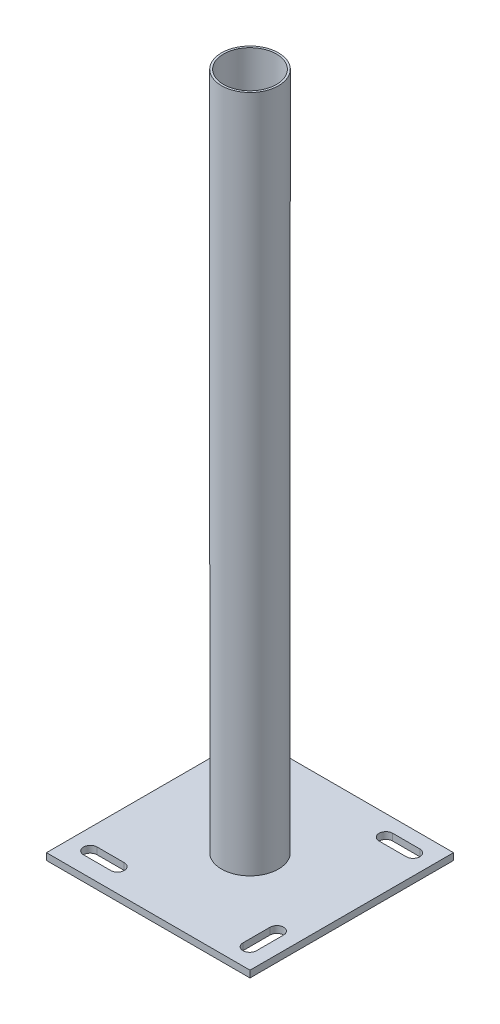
ISO-10303-21;
HEADER;
FILE_DESCRIPTION(('STEP AP214'),'2;1');
FILE_NAME('part.step','',(''),(''),'','','');
FILE_SCHEMA(('AUTOMOTIVE_DESIGN { 1 0 10303 214 1 1 1 1 }'));
ENDSEC;
DATA;
#1=APPLICATION_CONTEXT('core data for automotive mechanical design processes');
#2=APPLICATION_PROTOCOL_DEFINITION('international standard','automotive_design',2000,#1);
#3=PRODUCT_CONTEXT('',#1,'mechanical');
#4=PRODUCT('Part','Part','',(#3));
#5=PRODUCT_RELATED_PRODUCT_CATEGORY('part','',(#4));
#6=PRODUCT_DEFINITION_FORMATION('','',#4);
#7=PRODUCT_DEFINITION_CONTEXT('part definition',#1,'design');
#8=PRODUCT_DEFINITION('design','',#6,#7);
#9=PRODUCT_DEFINITION_SHAPE('','',#8);
#10=(LENGTH_UNIT() NAMED_UNIT(*) SI_UNIT(.MILLI.,.METRE.));
#11=(NAMED_UNIT(*) PLANE_ANGLE_UNIT() SI_UNIT($,.RADIAN.));
#12=(NAMED_UNIT(*) SI_UNIT($,.STERADIAN.) SOLID_ANGLE_UNIT());
#13=UNCERTAINTY_MEASURE_WITH_UNIT(LENGTH_MEASURE(1.E-05),#10,'distance_accuracy_value','');
#14=(GEOMETRIC_REPRESENTATION_CONTEXT(3) GLOBAL_UNCERTAINTY_ASSIGNED_CONTEXT((#13)) GLOBAL_UNIT_ASSIGNED_CONTEXT((#10,
#11,#12)) REPRESENTATION_CONTEXT('',''));
#15=CARTESIAN_POINT('',(0.,0.,0.));
#16=DIRECTION('',(0.,0.,1.));
#17=DIRECTION('',(1.,0.,0.));
#18=AXIS2_PLACEMENT_3D('',#15,#16,#17);
#19=CARTESIAN_POINT('',(-19.734,5.,-19.734));
#20=DIRECTION('',(0.,1.,0.));
#21=DIRECTION('',(0.,0.,1.));
#22=AXIS2_PLACEMENT_3D('',#19,#20,#21);
#23=PLANE('',#22);
#24=CARTESIAN_POINT('',(0.,5.,0.));
#25=DIRECTION('',(0.,-1.,0.));
#26=DIRECTION('',(0.,0.,-1.));
#27=AXIS2_PLACEMENT_3D('',#24,#25,#26);
#28=CIRCLE('',#27,19.5);
#29=CARTESIAN_POINT('',(0.,5.,-19.5));
#30=VERTEX_POINT('',#29);
#31=EDGE_CURVE('E21',#30,#30,#28,.F.);
#32=ORIENTED_EDGE('',*,*,#31,.T.);
#33=EDGE_LOOP('',(#32));
#34=FACE_BOUND('',#33,.T.);
#35=ADVANCED_FACE('F17',(#34),#23,.T.);
#36=CARTESIAN_POINT('',(0.,505.,0.));
#37=DIRECTION('',(0.,-1.,0.));
#38=DIRECTION('',(0.,0.,-1.));
#39=AXIS2_PLACEMENT_3D('',#36,#37,#38);
#40=CYLINDRICAL_SURFACE('',#39,19.5);
#41=CARTESIAN_POINT('',(0.,505.,0.));
#42=DIRECTION('',(0.,-1.,0.));
#43=DIRECTION('',(0.,0.,-1.));
#44=AXIS2_PLACEMENT_3D('',#41,#42,#43);
#45=CIRCLE('',#44,19.5);
#46=CARTESIAN_POINT('',(0.,505.,-19.5));
#47=VERTEX_POINT('',#46);
#48=EDGE_CURVE('E283',#47,#47,#45,.T.);
#49=ORIENTED_EDGE('',*,*,#48,.F.);
#50=EDGE_LOOP('',(#49));
#51=FACE_BOUND('',#50,.T.);
#52=ORIENTED_EDGE('',*,*,#31,.F.);
#53=EDGE_LOOP('',(#52));
#54=FACE_BOUND('',#53,.T.);
#55=ADVANCED_FACE('F291',(#51,#54),#40,.F.);
#56=CARTESIAN_POINT('',(-21.252,505.,-21.252));
#57=DIRECTION('',(0.,1.,0.));
#58=DIRECTION('',(0.,0.,1.));
#59=AXIS2_PLACEMENT_3D('',#56,#57,#58);
#60=PLANE('',#59);
#61=ORIENTED_EDGE('',*,*,#48,.T.);
#62=EDGE_LOOP('',(#61));
#63=FACE_BOUND('',#62,.T.);
#64=CARTESIAN_POINT('',(0.,505.,0.));
#65=DIRECTION('',(0.,-1.,0.));
#66=DIRECTION('',(0.,0.,-1.));
#67=AXIS2_PLACEMENT_3D('',#64,#65,#66);
#68=CIRCLE('',#67,21.);
#69=CARTESIAN_POINT('',(0.,505.,-21.));
#70=VERTEX_POINT('',#69);
#71=EDGE_CURVE('E226',#70,#70,#68,.T.);
#72=ORIENTED_EDGE('',*,*,#71,.F.);
#73=EDGE_LOOP('',(#72));
#74=FACE_BOUND('',#73,.T.);
#75=ADVANCED_FACE('F293',(#63,#74),#60,.T.);
#76=CARTESIAN_POINT('',(0.,505.,0.));
#77=DIRECTION('',(0.,-1.,0.));
#78=DIRECTION('',(0.,0.,-1.));
#79=AXIS2_PLACEMENT_3D('',#76,#77,#78);
#80=CYLINDRICAL_SURFACE('',#79,21.);
#81=CARTESIAN_POINT('',(0.,5.,0.));
#82=DIRECTION('',(0.,1.,0.));
#83=DIRECTION('',(0.,0.,1.));
#84=AXIS2_PLACEMENT_3D('',#81,#82,#83);
#85=CIRCLE('',#84,21.);
#86=CARTESIAN_POINT('',(0.,5.,21.));
#87=VERTEX_POINT('',#86);
#88=EDGE_CURVE('E221',#87,#87,#85,.F.);
#89=ORIENTED_EDGE('',*,*,#88,.F.);
#90=EDGE_LOOP('',(#89));
#91=FACE_BOUND('',#90,.T.);
#92=ORIENTED_EDGE('',*,*,#71,.T.);
#93=EDGE_LOOP('',(#92));
#94=FACE_BOUND('',#93,.T.);
#95=ADVANCED_FACE('F301',(#91,#94),#80,.T.);
#96=CARTESIAN_POINT('',(-75.,0.,-75.));
#97=DIRECTION('',(0.,0.,1.));
#98=DIRECTION('',(1.,0.,0.));
#99=AXIS2_PLACEMENT_3D('',#96,#97,#98);
#100=PLANE('',#99);
#101=DIRECTION('',(0.,1.,0.));
#102=VECTOR('',#101,1.);
#103=CARTESIAN_POINT('',(-75.,2.5,-75.));
#104=LINE('',#103,#102);
#105=CARTESIAN_POINT('',(-75.,0.,-75.));
#106=VERTEX_POINT('',#105);
#107=CARTESIAN_POINT('',(-75.,5.,-75.));
#108=VERTEX_POINT('',#107);
#109=EDGE_CURVE('E177',#106,#108,#104,.T.);
#110=ORIENTED_EDGE('',*,*,#109,.T.);
#111=DIRECTION('',(-1.,0.,0.));
#112=VECTOR('',#111,1.);
#113=CARTESIAN_POINT('',(0.,5.,-75.));
#114=LINE('',#113,#112);
#115=CARTESIAN_POINT('',(75.,5.,-75.));
#116=VERTEX_POINT('',#115);
#117=EDGE_CURVE('E169',#116,#108,#114,.T.);
#118=ORIENTED_EDGE('',*,*,#117,.F.);
#119=DIRECTION('',(0.,-1.,0.));
#120=VECTOR('',#119,1.);
#121=CARTESIAN_POINT('',(75.,2.5,-75.));
#122=LINE('',#121,#120);
#123=CARTESIAN_POINT('',(75.,0.,-75.));
#124=VERTEX_POINT('',#123);
#125=EDGE_CURVE('E156',#116,#124,#122,.T.);
#126=ORIENTED_EDGE('',*,*,#125,.T.);
#127=DIRECTION('',(-1.,0.,0.));
#128=VECTOR('',#127,1.);
#129=CARTESIAN_POINT('',(0.,0.,-75.));
#130=LINE('',#129,#128);
#131=EDGE_CURVE('E220',#124,#106,#130,.T.);
#132=ORIENTED_EDGE('',*,*,#131,.T.);
#133=EDGE_LOOP('',(#110,#118,#126,#132));
#134=FACE_BOUND('',#133,.T.);
#135=ADVANCED_FACE('F175',(#134),#100,.F.);
#136=CARTESIAN_POINT('',(-75.,0.,75.));
#137=DIRECTION('',(1.,0.,0.));
#138=DIRECTION('',(0.,0.,-1.));
#139=AXIS2_PLACEMENT_3D('',#136,#137,#138);
#140=PLANE('',#139);
#141=DIRECTION('',(0.,1.,0.));
#142=VECTOR('',#141,1.);
#143=CARTESIAN_POINT('',(-75.,2.5,75.));
#144=LINE('',#143,#142);
#145=CARTESIAN_POINT('',(-75.,0.,75.));
#146=VERTEX_POINT('',#145);
#147=CARTESIAN_POINT('',(-75.,5.,75.));
#148=VERTEX_POINT('',#147);
#149=EDGE_CURVE('E224',#146,#148,#144,.T.);
#150=ORIENTED_EDGE('',*,*,#149,.T.);
#151=DIRECTION('',(0.,0.,1.));
#152=VECTOR('',#151,1.);
#153=CARTESIAN_POINT('',(-75.,5.,0.));
#154=LINE('',#153,#152);
#155=EDGE_CURVE('E141',#108,#148,#154,.T.);
#156=ORIENTED_EDGE('',*,*,#155,.F.);
#157=ORIENTED_EDGE('',*,*,#109,.F.);
#158=DIRECTION('',(0.,0.,1.));
#159=VECTOR('',#158,1.);
#160=CARTESIAN_POINT('',(-75.,0.,0.));
#161=LINE('',#160,#159);
#162=EDGE_CURVE('E328',#106,#146,#161,.T.);
#163=ORIENTED_EDGE('',*,*,#162,.T.);
#164=EDGE_LOOP('',(#150,#156,#157,#163));
#165=FACE_BOUND('',#164,.T.);
#166=ADVANCED_FACE('F416',(#165),#140,.F.);
#167=CARTESIAN_POINT('',(75.,0.,75.));
#168=DIRECTION('',(0.,0.,-1.));
#169=DIRECTION('',(-1.,0.,0.));
#170=AXIS2_PLACEMENT_3D('',#167,#168,#169);
#171=PLANE('',#170);
#172=DIRECTION('',(0.,1.,0.));
#173=VECTOR('',#172,1.);
#174=CARTESIAN_POINT('',(75.,2.5,75.));
#175=LINE('',#174,#173);
#176=CARTESIAN_POINT('',(75.,0.,75.));
#177=VERTEX_POINT('',#176);
#178=CARTESIAN_POINT('',(75.,5.,75.));
#179=VERTEX_POINT('',#178);
#180=EDGE_CURVE('E166',#177,#179,#175,.T.);
#181=ORIENTED_EDGE('',*,*,#180,.T.);
#182=DIRECTION('',(1.,0.,0.));
#183=VECTOR('',#182,1.);
#184=CARTESIAN_POINT('',(0.,5.,75.));
#185=LINE('',#184,#183);
#186=EDGE_CURVE('E172',#148,#179,#185,.T.);
#187=ORIENTED_EDGE('',*,*,#186,.F.);
#188=ORIENTED_EDGE('',*,*,#149,.F.);
#189=DIRECTION('',(1.,0.,0.));
#190=VECTOR('',#189,1.);
#191=CARTESIAN_POINT('',(0.,0.,75.));
#192=LINE('',#191,#190);
#193=EDGE_CURVE('E321',#146,#177,#192,.T.);
#194=ORIENTED_EDGE('',*,*,#193,.T.);
#195=EDGE_LOOP('',(#181,#187,#188,#194));
#196=FACE_BOUND('',#195,.T.);
#197=ADVANCED_FACE('F413',(#196),#171,.F.);
#198=CARTESIAN_POINT('',(75.,0.,-75.));
#199=DIRECTION('',(-1.,0.,0.));
#200=DIRECTION('',(0.,0.,1.));
#201=AXIS2_PLACEMENT_3D('',#198,#199,#200);
#202=PLANE('',#201);
#203=ORIENTED_EDGE('',*,*,#125,.F.);
#204=DIRECTION('',(0.,0.,-1.));
#205=VECTOR('',#204,1.);
#206=CARTESIAN_POINT('',(75.,5.,0.));
#207=LINE('',#206,#205);
#208=EDGE_CURVE('E160',#179,#116,#207,.T.);
#209=ORIENTED_EDGE('',*,*,#208,.F.);
#210=ORIENTED_EDGE('',*,*,#180,.F.);
#211=DIRECTION('',(0.,0.,-1.));
#212=VECTOR('',#211,1.);
#213=CARTESIAN_POINT('',(75.,0.,0.));
#214=LINE('',#213,#212);
#215=EDGE_CURVE('E162',#177,#124,#214,.T.);
#216=ORIENTED_EDGE('',*,*,#215,.T.);
#217=EDGE_LOOP('',(#203,#209,#210,#216));
#218=FACE_BOUND('',#217,.T.);
#219=ADVANCED_FACE('F158',(#218),#202,.F.);
#220=CARTESIAN_POINT('',(54.965005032,0.,40.172757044));
#221=DIRECTION('',(-1.,0.,0.));
#222=DIRECTION('',(0.,0.,1.));
#223=AXIS2_PLACEMENT_3D('',#220,#221,#222);
#224=PLANE('',#223);
#225=DIRECTION('',(0.,0.,-1.));
#226=VECTOR('',#225,1.);
#227=CARTESIAN_POINT('',(54.96500505,5.,0.));
#228=LINE('',#227,#226);
#229=CARTESIAN_POINT('',(54.965005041,5.,60.172757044));
#230=VERTEX_POINT('',#229);
#231=CARTESIAN_POINT('',(54.965005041,5.,40.172757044));
#232=VERTEX_POINT('',#231);
#233=EDGE_CURVE('E279',#230,#232,#228,.T.);
#234=ORIENTED_EDGE('',*,*,#233,.F.);
#235=DIRECTION('',(0.,-1.,0.));
#236=VECTOR('',#235,1.);
#237=CARTESIAN_POINT('',(54.965005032,2.5,60.172757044));
#238=LINE('',#237,#236);
#239=CARTESIAN_POINT('',(54.965005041,0.,60.172757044));
#240=VERTEX_POINT('',#239);
#241=EDGE_CURVE('E218',#230,#240,#238,.T.);
#242=ORIENTED_EDGE('',*,*,#241,.T.);
#243=DIRECTION('',(0.,0.,-1.));
#244=VECTOR('',#243,1.);
#245=CARTESIAN_POINT('',(54.96500505,0.,0.));
#246=LINE('',#245,#244);
#247=CARTESIAN_POINT('',(54.965005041,0.,40.172757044));
#248=VERTEX_POINT('',#247);
#249=EDGE_CURVE('E258',#240,#248,#246,.T.);
#250=ORIENTED_EDGE('',*,*,#249,.T.);
#251=DIRECTION('',(0.,1.,0.));
#252=VECTOR('',#251,1.);
#253=CARTESIAN_POINT('',(54.965005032,2.5,40.172757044));
#254=LINE('',#253,#252);
#255=EDGE_CURVE('E132',#248,#232,#254,.T.);
#256=ORIENTED_EDGE('',*,*,#255,.T.);
#257=EDGE_LOOP('',(#234,#242,#250,#256));
#258=FACE_BOUND('',#257,.T.);
#259=ADVANCED_FACE('F317',(#258),#224,.F.);
#260=CARTESIAN_POINT('',(59.965005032,-0.5,40.172757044));
#261=DIRECTION('',(0.,1.,0.));
#262=DIRECTION('',(0.,0.,1.));
#263=AXIS2_PLACEMENT_3D('',#260,#261,#262);
#264=CYLINDRICAL_SURFACE('',#263,4.99999999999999);
#265=CARTESIAN_POINT('',(59.965005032,5.,40.172757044));
#266=DIRECTION('',(0.,1.,0.));
#267=DIRECTION('',(0.,0.,1.));
#268=AXIS2_PLACEMENT_3D('',#265,#266,#267);
#269=CIRCLE('',#268,4.99999999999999);
#270=CARTESIAN_POINT('',(64.965005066,5.,40.172757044));
#271=VERTEX_POINT('',#270);
#272=EDGE_CURVE('E280',#232,#271,#269,.F.);
#273=ORIENTED_EDGE('',*,*,#272,.F.);
#274=ORIENTED_EDGE('',*,*,#255,.F.);
#275=CARTESIAN_POINT('',(59.965005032,0.,40.172757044));
#276=DIRECTION('',(0.,1.,0.));
#277=DIRECTION('',(0.,0.,1.));
#278=AXIS2_PLACEMENT_3D('',#275,#276,#277);
#279=CIRCLE('',#278,4.99999999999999);
#280=CARTESIAN_POINT('',(64.965005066,0.,40.172757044));
#281=VERTEX_POINT('',#280);
#282=EDGE_CURVE('E255',#248,#281,#279,.F.);
#283=ORIENTED_EDGE('',*,*,#282,.T.);
#284=DIRECTION('',(0.,1.,0.));
#285=VECTOR('',#284,1.);
#286=CARTESIAN_POINT('',(64.965005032,2.5,40.172757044));
#287=LINE('',#286,#285);
#288=EDGE_CURVE('E173',#281,#271,#287,.T.);
#289=ORIENTED_EDGE('',*,*,#288,.T.);
#290=EDGE_LOOP('',(#273,#274,#283,#289));
#291=FACE_BOUND('',#290,.T.);
#292=ADVANCED_FACE('F348',(#291),#264,.F.);
#293=CARTESIAN_POINT('',(-39.965005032,-0.5,57.715011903));
#294=DIRECTION('',(0.,1.,0.));
#295=DIRECTION('',(-1.,0.,0.));
#296=AXIS2_PLACEMENT_3D('',#293,#294,#295);
#297=CYLINDRICAL_SURFACE('',#296,5.);
#298=CARTESIAN_POINT('',(-39.965005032,5.,57.715011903));
#299=DIRECTION('',(0.,1.,0.));
#300=DIRECTION('',(-1.,0.,0.));
#301=AXIS2_PLACEMENT_3D('',#298,#299,#300);
#302=CIRCLE('',#301,5.);
#303=CARTESIAN_POINT('',(-39.965005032,5.,52.7150119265));
#304=VERTEX_POINT('',#303);
#305=CARTESIAN_POINT('',(-39.965005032,5.,62.7150118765));
#306=VERTEX_POINT('',#305);
#307=EDGE_CURVE('E274',#304,#306,#302,.F.);
#308=ORIENTED_EDGE('',*,*,#307,.F.);
#309=DIRECTION('',(0.,-1.,0.));
#310=VECTOR('',#309,1.);
#311=CARTESIAN_POINT('',(-39.965005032,2.5,52.715011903));
#312=LINE('',#311,#310);
#313=CARTESIAN_POINT('',(-39.965005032,0.,52.7150119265));
#314=VERTEX_POINT('',#313);
#315=EDGE_CURVE('E204',#304,#314,#312,.T.);
#316=ORIENTED_EDGE('',*,*,#315,.T.);
#317=CARTESIAN_POINT('',(-39.965005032,0.,57.715011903));
#318=DIRECTION('',(0.,1.,0.));
#319=DIRECTION('',(-1.,0.,0.));
#320=AXIS2_PLACEMENT_3D('',#317,#318,#319);
#321=CIRCLE('',#320,5.);
#322=CARTESIAN_POINT('',(-39.965005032,0.,62.7150118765));
#323=VERTEX_POINT('',#322);
#324=EDGE_CURVE('E251',#314,#323,#321,.F.);
#325=ORIENTED_EDGE('',*,*,#324,.T.);
#326=DIRECTION('',(0.,1.,0.));
#327=VECTOR('',#326,1.);
#328=CARTESIAN_POINT('',(-39.965005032,2.5,62.715011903));
#329=LINE('',#328,#327);
#330=EDGE_CURVE('E212',#323,#306,#329,.T.);
#331=ORIENTED_EDGE('',*,*,#330,.T.);
#332=EDGE_LOOP('',(#308,#316,#325,#331));
#333=FACE_BOUND('',#332,.T.);
#334=ADVANCED_FACE('F402',(#333),#297,.F.);
#335=CARTESIAN_POINT('',(-59.965005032,0.,62.715011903));
#336=DIRECTION('',(0.,0.,1.));
#337=DIRECTION('',(1.,0.,0.));
#338=AXIS2_PLACEMENT_3D('',#335,#336,#337);
#339=PLANE('',#338);
#340=DIRECTION('',(-1.,0.,0.));
#341=VECTOR('',#340,1.);
#342=CARTESIAN_POINT('',(0.,5.,62.71501185));
#343=LINE('',#342,#341);
#344=CARTESIAN_POINT('',(-59.965005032,5.,62.7150118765));
#345=VERTEX_POINT('',#344);
#346=EDGE_CURVE('E273',#306,#345,#343,.T.);
#347=ORIENTED_EDGE('',*,*,#346,.F.);
#348=ORIENTED_EDGE('',*,*,#330,.F.);
#349=DIRECTION('',(-1.,0.,0.));
#350=VECTOR('',#349,1.);
#351=CARTESIAN_POINT('',(0.,0.,62.71501185));
#352=LINE('',#351,#350);
#353=CARTESIAN_POINT('',(-59.965005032,0.,62.7150118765));
#354=VERTEX_POINT('',#353);
#355=EDGE_CURVE('E250',#323,#354,#352,.T.);
#356=ORIENTED_EDGE('',*,*,#355,.T.);
#357=DIRECTION('',(0.,1.,0.));
#358=VECTOR('',#357,1.);
#359=CARTESIAN_POINT('',(-59.965005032,2.5,62.715011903));
#360=LINE('',#359,#358);
#361=EDGE_CURVE('E208',#354,#345,#360,.T.);
#362=ORIENTED_EDGE('',*,*,#361,.T.);
#363=EDGE_LOOP('',(#347,#348,#356,#362));
#364=FACE_BOUND('',#363,.T.);
#365=ADVANCED_FACE('F398',(#364),#339,.F.);
#366=CARTESIAN_POINT('',(-59.965005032,-0.5,57.715011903));
#367=DIRECTION('',(0.,1.,0.));
#368=DIRECTION('',(0.,0.,1.));
#369=AXIS2_PLACEMENT_3D('',#366,#367,#368);
#370=CYLINDRICAL_SURFACE('',#369,5.);
#371=CARTESIAN_POINT('',(-59.965005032,5.,57.715011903));
#372=DIRECTION('',(0.,1.,0.));
#373=DIRECTION('',(0.,0.,1.));
#374=AXIS2_PLACEMENT_3D('',#371,#372,#373);
#375=CIRCLE('',#374,5.);
#376=CARTESIAN_POINT('',(-59.965005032,5.,52.7150119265));
#377=VERTEX_POINT('',#376);
#378=EDGE_CURVE('E277',#345,#377,#375,.F.);
#379=ORIENTED_EDGE('',*,*,#378,.F.);
#380=ORIENTED_EDGE('',*,*,#361,.F.);
#381=CARTESIAN_POINT('',(-59.965005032,0.,57.715011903));
#382=DIRECTION('',(0.,1.,0.));
#383=DIRECTION('',(0.,0.,1.));
#384=AXIS2_PLACEMENT_3D('',#381,#382,#383);
#385=CIRCLE('',#384,5.);
#386=CARTESIAN_POINT('',(-59.965005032,0.,52.7150119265));
#387=VERTEX_POINT('',#386);
#388=EDGE_CURVE('E247',#354,#387,#385,.F.);
#389=ORIENTED_EDGE('',*,*,#388,.T.);
#390=DIRECTION('',(0.,1.,0.));
#391=VECTOR('',#390,1.);
#392=CARTESIAN_POINT('',(-59.965005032,2.5,52.715011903));
#393=LINE('',#392,#391);
#394=EDGE_CURVE('E205',#387,#377,#393,.T.);
#395=ORIENTED_EDGE('',*,*,#394,.T.);
#396=EDGE_LOOP('',(#379,#380,#389,#395));
#397=FACE_BOUND('',#396,.T.);
#398=ADVANCED_FACE('F394',(#397),#370,.F.);
#399=CARTESIAN_POINT('',(-39.965005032,0.,52.715011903));
#400=DIRECTION('',(0.,0.,-1.));
#401=DIRECTION('',(-1.,0.,0.));
#402=AXIS2_PLACEMENT_3D('',#399,#400,#401);
#403=PLANE('',#402);
#404=DIRECTION('',(1.,0.,0.));
#405=VECTOR('',#404,1.);
#406=CARTESIAN_POINT('',(0.,5.,52.71501195));
#407=LINE('',#406,#405);
#408=EDGE_CURVE('E276',#377,#304,#407,.T.);
#409=ORIENTED_EDGE('',*,*,#408,.F.);
#410=ORIENTED_EDGE('',*,*,#394,.F.);
#411=DIRECTION('',(1.,0.,0.));
#412=VECTOR('',#411,1.);
#413=CARTESIAN_POINT('',(0.,0.,52.71501195));
#414=LINE('',#413,#412);
#415=EDGE_CURVE('E246',#387,#314,#414,.T.);
#416=ORIENTED_EDGE('',*,*,#415,.T.);
#417=ORIENTED_EDGE('',*,*,#315,.F.);
#418=EDGE_LOOP('',(#409,#410,#416,#417));
#419=FACE_BOUND('',#418,.T.);
#420=ADVANCED_FACE('F390',(#419),#403,.F.);
#421=CARTESIAN_POINT('',(60.172757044,-0.5,-59.965005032));
#422=DIRECTION('',(0.,1.,0.));
#423=DIRECTION('',(-1.,0.,0.));
#424=AXIS2_PLACEMENT_3D('',#421,#422,#423);
#425=CYLINDRICAL_SURFACE('',#424,4.99999999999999);
#426=CARTESIAN_POINT('',(60.172757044,5.,-59.965005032));
#427=DIRECTION('',(0.,1.,0.));
#428=DIRECTION('',(-1.,0.,0.));
#429=AXIS2_PLACEMENT_3D('',#426,#427,#428);
#430=CIRCLE('',#429,4.99999999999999);
#431=CARTESIAN_POINT('',(60.172757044,5.,-64.965005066));
#432=VERTEX_POINT('',#431);
#433=CARTESIAN_POINT('',(60.172757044,5.,-54.965005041));
#434=VERTEX_POINT('',#433);
#435=EDGE_CURVE('E268',#432,#434,#430,.F.);
#436=ORIENTED_EDGE('',*,*,#435,.F.);
#437=DIRECTION('',(0.,-1.,0.));
#438=VECTOR('',#437,1.);
#439=CARTESIAN_POINT('',(60.172757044,2.5,-64.965005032));
#440=LINE('',#439,#438);
#441=CARTESIAN_POINT('',(60.172757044,0.,-64.965005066));
#442=VERTEX_POINT('',#441);
#443=EDGE_CURVE('E193',#432,#442,#440,.T.);
#444=ORIENTED_EDGE('',*,*,#443,.T.);
#445=CARTESIAN_POINT('',(60.172757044,0.,-59.965005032));
#446=DIRECTION('',(0.,1.,0.));
#447=DIRECTION('',(-1.,0.,0.));
#448=AXIS2_PLACEMENT_3D('',#445,#446,#447);
#449=CIRCLE('',#448,4.99999999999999);
#450=CARTESIAN_POINT('',(60.172757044,0.,-54.965005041));
#451=VERTEX_POINT('',#450);
#452=EDGE_CURVE('E243',#442,#451,#449,.F.);
#453=ORIENTED_EDGE('',*,*,#452,.T.);
#454=DIRECTION('',(0.,1.,0.));
#455=VECTOR('',#454,1.);
#456=CARTESIAN_POINT('',(60.172757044,2.5,-54.965005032));
#457=LINE('',#456,#455);
#458=EDGE_CURVE('E201',#451,#434,#457,.T.);
#459=ORIENTED_EDGE('',*,*,#458,.T.);
#460=EDGE_LOOP('',(#436,#444,#453,#459));
#461=FACE_BOUND('',#460,.T.);
#462=ADVANCED_FACE('F386',(#461),#425,.F.);
#463=CARTESIAN_POINT('',(40.172757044,0.,-54.965005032));
#464=DIRECTION('',(0.,0.,1.));
#465=DIRECTION('',(1.,0.,0.));
#466=AXIS2_PLACEMENT_3D('',#463,#464,#465);
#467=PLANE('',#466);
#468=DIRECTION('',(-1.,0.,0.));
#469=VECTOR('',#468,1.);
#470=CARTESIAN_POINT('',(0.,5.,-54.96500505));
#471=LINE('',#470,#469);
#472=CARTESIAN_POINT('',(40.172757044,5.,-54.965005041));
#473=VERTEX_POINT('',#472);
#474=EDGE_CURVE('E267',#434,#473,#471,.T.);
#475=ORIENTED_EDGE('',*,*,#474,.F.);
#476=ORIENTED_EDGE('',*,*,#458,.F.);
#477=DIRECTION('',(-1.,0.,0.));
#478=VECTOR('',#477,1.);
#479=CARTESIAN_POINT('',(0.,0.,-54.96500505));
#480=LINE('',#479,#478);
#481=CARTESIAN_POINT('',(40.172757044,0.,-54.965005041));
#482=VERTEX_POINT('',#481);
#483=EDGE_CURVE('E242',#451,#482,#480,.T.);
#484=ORIENTED_EDGE('',*,*,#483,.T.);
#485=DIRECTION('',(0.,1.,0.));
#486=VECTOR('',#485,1.);
#487=CARTESIAN_POINT('',(40.172757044,2.5,-54.965005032));
#488=LINE('',#487,#486);
#489=EDGE_CURVE('E197',#482,#473,#488,.T.);
#490=ORIENTED_EDGE('',*,*,#489,.T.);
#491=EDGE_LOOP('',(#475,#476,#484,#490));
#492=FACE_BOUND('',#491,.T.);
#493=ADVANCED_FACE('F382',(#492),#467,.F.);
#494=CARTESIAN_POINT('',(40.172757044,-0.5,-59.965005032));
#495=DIRECTION('',(0.,1.,0.));
#496=DIRECTION('',(0.,0.,1.));
#497=AXIS2_PLACEMENT_3D('',#494,#495,#496);
#498=CYLINDRICAL_SURFACE('',#497,4.99999999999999);
#499=CARTESIAN_POINT('',(40.172757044,5.,-59.965005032));
#500=DIRECTION('',(0.,1.,0.));
#501=DIRECTION('',(0.,0.,1.));
#502=AXIS2_PLACEMENT_3D('',#499,#500,#501);
#503=CIRCLE('',#502,4.99999999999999);
#504=CARTESIAN_POINT('',(40.172757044,5.,-64.965005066));
#505=VERTEX_POINT('',#504);
#506=EDGE_CURVE('E271',#473,#505,#503,.F.);
#507=ORIENTED_EDGE('',*,*,#506,.F.);
#508=ORIENTED_EDGE('',*,*,#489,.F.);
#509=CARTESIAN_POINT('',(40.172757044,0.,-59.965005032));
#510=DIRECTION('',(0.,1.,0.));
#511=DIRECTION('',(0.,0.,1.));
#512=AXIS2_PLACEMENT_3D('',#509,#510,#511);
#513=CIRCLE('',#512,4.99999999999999);
#514=CARTESIAN_POINT('',(40.172757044,0.,-64.965005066));
#515=VERTEX_POINT('',#514);
#516=EDGE_CURVE('E239',#482,#515,#513,.F.);
#517=ORIENTED_EDGE('',*,*,#516,.T.);
#518=DIRECTION('',(0.,1.,0.));
#519=VECTOR('',#518,1.);
#520=CARTESIAN_POINT('',(40.172757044,2.5,-64.965005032));
#521=LINE('',#520,#519);
#522=EDGE_CURVE('E194',#515,#505,#521,.T.);
#523=ORIENTED_EDGE('',*,*,#522,.T.);
#524=EDGE_LOOP('',(#507,#508,#517,#523));
#525=FACE_BOUND('',#524,.T.);
#526=ADVANCED_FACE('F378',(#525),#498,.F.);
#527=CARTESIAN_POINT('',(60.172757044,0.,-64.965005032));
#528=DIRECTION('',(0.,0.,-1.));
#529=DIRECTION('',(-1.,0.,0.));
#530=AXIS2_PLACEMENT_3D('',#527,#528,#529);
#531=PLANE('',#530);
#532=DIRECTION('',(1.,0.,0.));
#533=VECTOR('',#532,1.);
#534=CARTESIAN_POINT('',(0.,5.,-64.9650051));
#535=LINE('',#534,#533);
#536=EDGE_CURVE('E270',#505,#432,#535,.T.);
#537=ORIENTED_EDGE('',*,*,#536,.F.);
#538=ORIENTED_EDGE('',*,*,#522,.F.);
#539=DIRECTION('',(1.,0.,0.));
#540=VECTOR('',#539,1.);
#541=CARTESIAN_POINT('',(0.,0.,-64.9650051));
#542=LINE('',#541,#540);
#543=EDGE_CURVE('E238',#515,#442,#542,.T.);
#544=ORIENTED_EDGE('',*,*,#543,.T.);
#545=ORIENTED_EDGE('',*,*,#443,.F.);
#546=EDGE_LOOP('',(#537,#538,#544,#545));
#547=FACE_BOUND('',#546,.T.);
#548=ADVANCED_FACE('F374',(#547),#531,.F.);
#549=CARTESIAN_POINT('',(-57.715011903,-0.5,-39.965005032));
#550=DIRECTION('',(0.,1.,0.));
#551=DIRECTION('',(-1.,0.,0.));
#552=AXIS2_PLACEMENT_3D('',#549,#550,#551);
#553=CYLINDRICAL_SURFACE('',#552,5.);
#554=CARTESIAN_POINT('',(-57.715011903,0.,-39.965005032));
#555=DIRECTION('',(0.,1.,0.));
#556=DIRECTION('',(-1.,0.,0.));
#557=AXIS2_PLACEMENT_3D('',#554,#555,#556);
#558=CIRCLE('',#557,5.);
#559=CARTESIAN_POINT('',(-52.7150119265,0.,-39.965005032));
#560=VERTEX_POINT('',#559);
#561=CARTESIAN_POINT('',(-62.7150118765,0.,-39.965005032));
#562=VERTEX_POINT('',#561);
#563=EDGE_CURVE('E235',#560,#562,#558,.F.);
#564=ORIENTED_EDGE('',*,*,#563,.T.);
#565=DIRECTION('',(0.,1.,0.));
#566=VECTOR('',#565,1.);
#567=CARTESIAN_POINT('',(-62.715011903,2.5,-39.965005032));
#568=LINE('',#567,#566);
#569=CARTESIAN_POINT('',(-62.7150118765,5.,-39.965005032));
#570=VERTEX_POINT('',#569);
#571=EDGE_CURVE('E190',#562,#570,#568,.T.);
#572=ORIENTED_EDGE('',*,*,#571,.T.);
#573=CARTESIAN_POINT('',(-57.715011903,5.,-39.965005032));
#574=DIRECTION('',(0.,1.,0.));
#575=DIRECTION('',(-1.,0.,0.));
#576=AXIS2_PLACEMENT_3D('',#573,#574,#575);
#577=CIRCLE('',#576,5.);
#578=CARTESIAN_POINT('',(-52.7150119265,5.,-39.965005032));
#579=VERTEX_POINT('',#578);
#580=EDGE_CURVE('E262',#579,#570,#577,.F.);
#581=ORIENTED_EDGE('',*,*,#580,.F.);
#582=DIRECTION('',(0.,-1.,0.));
#583=VECTOR('',#582,1.);
#584=CARTESIAN_POINT('',(-52.715011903,2.5,-39.965005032));
#585=LINE('',#584,#583);
#586=EDGE_CURVE('E185',#579,#560,#585,.T.);
#587=ORIENTED_EDGE('',*,*,#586,.T.);
#588=EDGE_LOOP('',(#564,#572,#581,#587));
#589=FACE_BOUND('',#588,.T.);
#590=ADVANCED_FACE('F370',(#589),#553,.F.);
#591=CARTESIAN_POINT('',(-62.715011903,0.,-59.965005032));
#592=DIRECTION('',(-1.,0.,0.));
#593=DIRECTION('',(0.,0.,1.));
#594=AXIS2_PLACEMENT_3D('',#591,#592,#593);
#595=PLANE('',#594);
#596=DIRECTION('',(0.,0.,-1.));
#597=VECTOR('',#596,1.);
#598=CARTESIAN_POINT('',(-62.71501185,5.,0.));
#599=LINE('',#598,#597);
#600=CARTESIAN_POINT('',(-62.7150118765,5.,-59.965005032));
#601=VERTEX_POINT('',#600);
#602=EDGE_CURVE('E261',#570,#601,#599,.T.);
#603=ORIENTED_EDGE('',*,*,#602,.F.);
#604=ORIENTED_EDGE('',*,*,#571,.F.);
#605=DIRECTION('',(0.,0.,-1.));
#606=VECTOR('',#605,1.);
#607=CARTESIAN_POINT('',(-62.71501185,0.,0.));
#608=LINE('',#607,#606);
#609=CARTESIAN_POINT('',(-62.7150118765,0.,-59.965005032));
#610=VERTEX_POINT('',#609);
#611=EDGE_CURVE('E234',#562,#610,#608,.T.);
#612=ORIENTED_EDGE('',*,*,#611,.T.);
#613=DIRECTION('',(0.,1.,0.));
#614=VECTOR('',#613,1.);
#615=CARTESIAN_POINT('',(-62.715011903,2.5,-59.965005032));
#616=LINE('',#615,#614);
#617=EDGE_CURVE('E186',#610,#601,#616,.T.);
#618=ORIENTED_EDGE('',*,*,#617,.T.);
#619=EDGE_LOOP('',(#603,#604,#612,#618));
#620=FACE_BOUND('',#619,.T.);
#621=ADVANCED_FACE('F366',(#620),#595,.F.);
#622=CARTESIAN_POINT('',(-57.715011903,-0.5,-59.965005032));
#623=DIRECTION('',(0.,1.,0.));
#624=DIRECTION('',(0.,0.,1.));
#625=AXIS2_PLACEMENT_3D('',#622,#623,#624);
#626=CYLINDRICAL_SURFACE('',#625,5.);
#627=CARTESIAN_POINT('',(-57.715011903,5.,-59.965005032));
#628=DIRECTION('',(0.,1.,0.));
#629=DIRECTION('',(0.,0.,1.));
#630=AXIS2_PLACEMENT_3D('',#627,#628,#629);
#631=CIRCLE('',#630,5.);
#632=CARTESIAN_POINT('',(-52.7150119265,5.,-59.965005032));
#633=VERTEX_POINT('',#632);
#634=EDGE_CURVE('E265',#601,#633,#631,.F.);
#635=ORIENTED_EDGE('',*,*,#634,.F.);
#636=ORIENTED_EDGE('',*,*,#617,.F.);
#637=CARTESIAN_POINT('',(-57.715011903,0.,-59.965005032));
#638=DIRECTION('',(0.,1.,0.));
#639=DIRECTION('',(0.,0.,1.));
#640=AXIS2_PLACEMENT_3D('',#637,#638,#639);
#641=CIRCLE('',#640,5.);
#642=CARTESIAN_POINT('',(-52.7150119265,0.,-59.965005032));
#643=VERTEX_POINT('',#642);
#644=EDGE_CURVE('E230',#610,#643,#641,.F.);
#645=ORIENTED_EDGE('',*,*,#644,.T.);
#646=DIRECTION('',(0.,1.,0.));
#647=VECTOR('',#646,1.);
#648=CARTESIAN_POINT('',(-52.715011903,2.5,-59.965005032));
#649=LINE('',#648,#647);
#650=EDGE_CURVE('E182',#643,#633,#649,.T.);
#651=ORIENTED_EDGE('',*,*,#650,.T.);
#652=EDGE_LOOP('',(#635,#636,#645,#651));
#653=FACE_BOUND('',#652,.T.);
#654=ADVANCED_FACE('F360',(#653),#626,.F.);
#655=CARTESIAN_POINT('',(-52.715011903,0.,-39.965005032));
#656=DIRECTION('',(1.,0.,0.));
#657=DIRECTION('',(0.,0.,-1.));
#658=AXIS2_PLACEMENT_3D('',#655,#656,#657);
#659=PLANE('',#658);
#660=DIRECTION('',(0.,0.,1.));
#661=VECTOR('',#660,1.);
#662=CARTESIAN_POINT('',(-52.71501195,5.,0.));
#663=LINE('',#662,#661);
#664=EDGE_CURVE('E264',#633,#579,#663,.T.);
#665=ORIENTED_EDGE('',*,*,#664,.F.);
#666=ORIENTED_EDGE('',*,*,#650,.F.);
#667=DIRECTION('',(0.,0.,1.));
#668=VECTOR('',#667,1.);
#669=CARTESIAN_POINT('',(-52.71501195,0.,0.));
#670=LINE('',#669,#668);
#671=EDGE_CURVE('E233',#643,#560,#670,.T.);
#672=ORIENTED_EDGE('',*,*,#671,.T.);
#673=ORIENTED_EDGE('',*,*,#586,.F.);
#674=EDGE_LOOP('',(#665,#666,#672,#673));
#675=FACE_BOUND('',#674,.T.);
#676=ADVANCED_FACE('F352',(#675),#659,.F.);
#677=CARTESIAN_POINT('',(64.965005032,0.,60.172757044));
#678=DIRECTION('',(1.,0.,0.));
#679=DIRECTION('',(0.,0.,-1.));
#680=AXIS2_PLACEMENT_3D('',#677,#678,#679);
#681=PLANE('',#680);
#682=DIRECTION('',(0.,0.,1.));
#683=VECTOR('',#682,1.);
#684=CARTESIAN_POINT('',(64.9650051,5.,0.));
#685=LINE('',#684,#683);
#686=CARTESIAN_POINT('',(64.965005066,5.,60.172757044));
#687=VERTEX_POINT('',#686);
#688=EDGE_CURVE('E36',#271,#687,#685,.T.);
#689=ORIENTED_EDGE('',*,*,#688,.F.);
#690=ORIENTED_EDGE('',*,*,#288,.F.);
#691=DIRECTION('',(0.,0.,1.));
#692=VECTOR('',#691,1.);
#693=CARTESIAN_POINT('',(64.9650051,0.,0.));
#694=LINE('',#693,#692);
#695=CARTESIAN_POINT('',(64.965005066,0.,60.172757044));
#696=VERTEX_POINT('',#695);
#697=EDGE_CURVE('E254',#281,#696,#694,.T.);
#698=ORIENTED_EDGE('',*,*,#697,.T.);
#699=DIRECTION('',(0.,1.,0.));
#700=VECTOR('',#699,1.);
#701=CARTESIAN_POINT('',(64.965005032,2.5,60.172757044));
#702=LINE('',#701,#700);
#703=EDGE_CURVE('E229',#696,#687,#702,.T.);
#704=ORIENTED_EDGE('',*,*,#703,.T.);
#705=EDGE_LOOP('',(#689,#690,#698,#704));
#706=FACE_BOUND('',#705,.T.);
#707=ADVANCED_FACE('F350',(#706),#681,.F.);
#708=CARTESIAN_POINT('',(-75.,5.,-75.));
#709=DIRECTION('',(0.,1.,0.));
#710=DIRECTION('',(0.,0.,1.));
#711=AXIS2_PLACEMENT_3D('',#708,#709,#710);
#712=PLANE('',#711);
#713=ORIENTED_EDGE('',*,*,#88,.T.);
#714=EDGE_LOOP('',(#713));
#715=FACE_BOUND('',#714,.T.);
#716=ORIENTED_EDGE('',*,*,#580,.T.);
#717=ORIENTED_EDGE('',*,*,#602,.T.);
#718=ORIENTED_EDGE('',*,*,#634,.T.);
#719=ORIENTED_EDGE('',*,*,#664,.T.);
#720=EDGE_LOOP('',(#716,#717,#718,#719));
#721=FACE_BOUND('',#720,.T.);
#722=ORIENTED_EDGE('',*,*,#435,.T.);
#723=ORIENTED_EDGE('',*,*,#474,.T.);
#724=ORIENTED_EDGE('',*,*,#506,.T.);
#725=ORIENTED_EDGE('',*,*,#536,.T.);
#726=EDGE_LOOP('',(#722,#723,#724,#725));
#727=FACE_BOUND('',#726,.T.);
#728=ORIENTED_EDGE('',*,*,#307,.T.);
#729=ORIENTED_EDGE('',*,*,#346,.T.);
#730=ORIENTED_EDGE('',*,*,#378,.T.);
#731=ORIENTED_EDGE('',*,*,#408,.T.);
#732=EDGE_LOOP('',(#728,#729,#730,#731));
#733=FACE_BOUND('',#732,.T.);
#734=CARTESIAN_POINT('',(59.965005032,5.,60.172757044));
#735=DIRECTION('',(0.,1.,0.));
#736=DIRECTION('',(0.,0.,1.));
#737=AXIS2_PLACEMENT_3D('',#734,#735,#736);
#738=CIRCLE('',#737,4.99999999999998);
#739=EDGE_CURVE('E27',#687,#230,#738,.F.);
#740=ORIENTED_EDGE('',*,*,#739,.T.);
#741=ORIENTED_EDGE('',*,*,#233,.T.);
#742=ORIENTED_EDGE('',*,*,#272,.T.);
#743=ORIENTED_EDGE('',*,*,#688,.T.);
#744=EDGE_LOOP('',(#740,#741,#742,#743));
#745=FACE_BOUND('',#744,.T.);
#746=ORIENTED_EDGE('',*,*,#155,.T.);
#747=ORIENTED_EDGE('',*,*,#186,.T.);
#748=ORIENTED_EDGE('',*,*,#208,.T.);
#749=ORIENTED_EDGE('',*,*,#117,.T.);
#750=EDGE_LOOP('',(#746,#747,#748,#749));
#751=FACE_BOUND('',#750,.T.);
#752=ADVANCED_FACE('F168',(#715,#721,#727,#733,#745,#751),#712,.T.);
#753=CARTESIAN_POINT('',(-75.,0.,-75.));
#754=DIRECTION('',(0.,1.,0.));
#755=DIRECTION('',(0.,0.,1.));
#756=AXIS2_PLACEMENT_3D('',#753,#754,#755);
#757=PLANE('',#756);
#758=ORIENTED_EDGE('',*,*,#644,.F.);
#759=ORIENTED_EDGE('',*,*,#611,.F.);
#760=ORIENTED_EDGE('',*,*,#563,.F.);
#761=ORIENTED_EDGE('',*,*,#671,.F.);
#762=EDGE_LOOP('',(#758,#759,#760,#761));
#763=FACE_BOUND('',#762,.T.);
#764=ORIENTED_EDGE('',*,*,#516,.F.);
#765=ORIENTED_EDGE('',*,*,#483,.F.);
#766=ORIENTED_EDGE('',*,*,#452,.F.);
#767=ORIENTED_EDGE('',*,*,#543,.F.);
#768=EDGE_LOOP('',(#764,#765,#766,#767));
#769=FACE_BOUND('',#768,.T.);
#770=ORIENTED_EDGE('',*,*,#388,.F.);
#771=ORIENTED_EDGE('',*,*,#355,.F.);
#772=ORIENTED_EDGE('',*,*,#324,.F.);
#773=ORIENTED_EDGE('',*,*,#415,.F.);
#774=EDGE_LOOP('',(#770,#771,#772,#773));
#775=FACE_BOUND('',#774,.T.);
#776=ORIENTED_EDGE('',*,*,#282,.F.);
#777=ORIENTED_EDGE('',*,*,#249,.F.);
#778=CARTESIAN_POINT('',(59.965005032,0.,60.172757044));
#779=DIRECTION('',(0.,1.,0.));
#780=DIRECTION('',(0.,0.,1.));
#781=AXIS2_PLACEMENT_3D('',#778,#779,#780);
#782=CIRCLE('',#781,4.99999999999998);
#783=EDGE_CURVE('E11',#240,#696,#782,.T.);
#784=ORIENTED_EDGE('',*,*,#783,.T.);
#785=ORIENTED_EDGE('',*,*,#697,.F.);
#786=EDGE_LOOP('',(#776,#777,#784,#785));
#787=FACE_BOUND('',#786,.T.);
#788=ORIENTED_EDGE('',*,*,#193,.F.);
#789=ORIENTED_EDGE('',*,*,#162,.F.);
#790=ORIENTED_EDGE('',*,*,#131,.F.);
#791=ORIENTED_EDGE('',*,*,#215,.F.);
#792=EDGE_LOOP('',(#788,#789,#790,#791));
#793=FACE_BOUND('',#792,.T.);
#794=ADVANCED_FACE('F305',(#763,#769,#775,#787,#793),#757,.F.);
#795=CARTESIAN_POINT('',(59.965005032,-0.5,60.172757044));
#796=DIRECTION('',(0.,1.,0.));
#797=DIRECTION('',(0.,0.,1.));
#798=AXIS2_PLACEMENT_3D('',#795,#796,#797);
#799=CYLINDRICAL_SURFACE('',#798,4.99999999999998);
#800=ORIENTED_EDGE('',*,*,#783,.F.);
#801=ORIENTED_EDGE('',*,*,#241,.F.);
#802=ORIENTED_EDGE('',*,*,#739,.F.);
#803=ORIENTED_EDGE('',*,*,#703,.F.);
#804=EDGE_LOOP('',(#800,#801,#802,#803));
#805=FACE_BOUND('',#804,.T.);
#806=ADVANCED_FACE('F19',(#805),#799,.F.);
#807=CLOSED_SHELL('',(#35,#55,#75,#95,#135,#166,#197,#219,#259,#292,#334,#365,#398,#420,#462,
#493,#526,#548,#590,#621,#654,#676,#707,#752,#794,#806));
#808=MANIFOLD_SOLID_BREP('B1',#807);
#809=ADVANCED_BREP_SHAPE_REPRESENTATION('',(#18,#808),#14);
#810=SHAPE_DEFINITION_REPRESENTATION(#9,#809);
ENDSEC;
END-ISO-10303-21;
